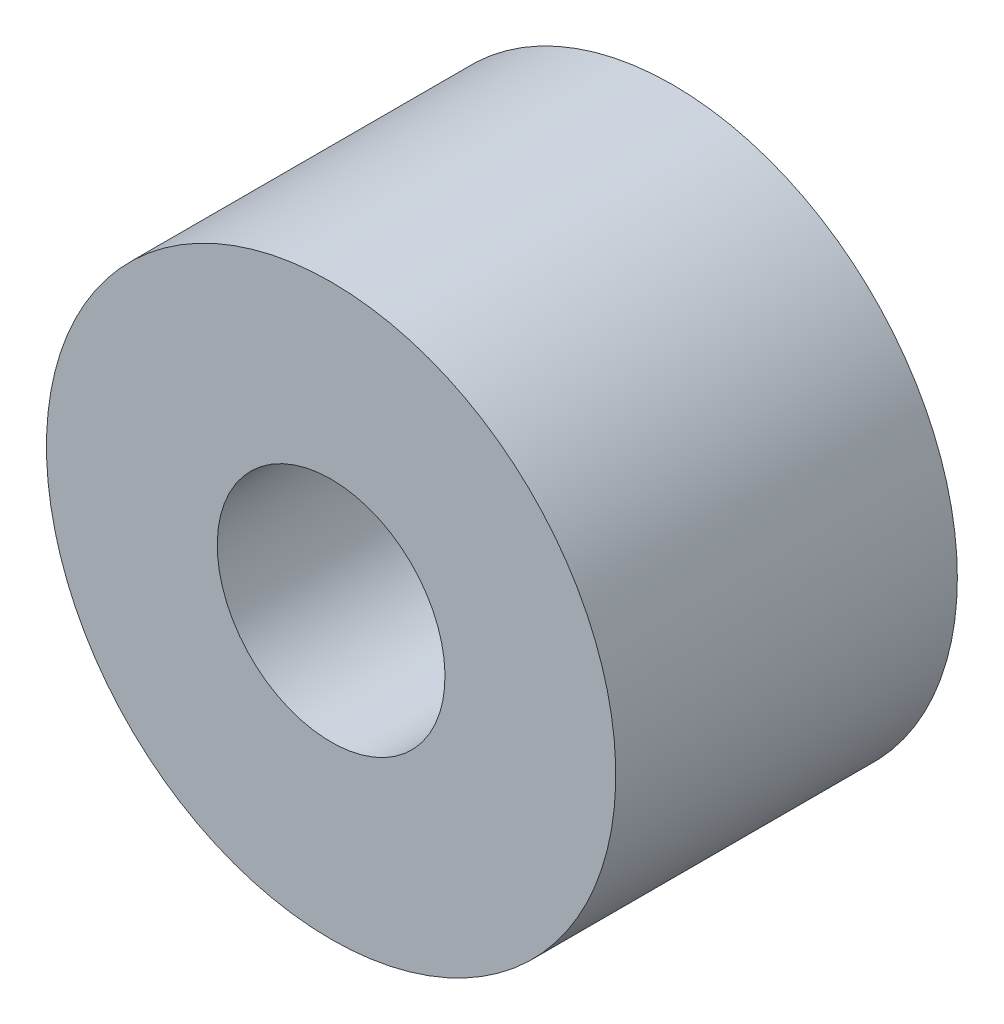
from build123d import *

# Parameters (mm, degrees)
SKETCH2_R           = 5
SKETCH2_R_2         = 2
BOSS_EXTRUDE1_DEPTH = 6


with BuildPart() as part:
    # Sketch2 → Boss-Extrude1 (new body)
    with BuildSketch(Plane.XY.offset(173.948178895)):
        with Locations(Location((25.5875, 69.755158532, 0), (0, 0, 90))):
            Circle(SKETCH2_R)
        with Locations(Location((25.5875, 69.755158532, 0), (0, 0, 90))):
            Circle(SKETCH2_R_2, mode=Mode.SUBTRACT)
    extrude(amount=BOSS_EXTRUDE1_DEPTH)


solid = part.part
